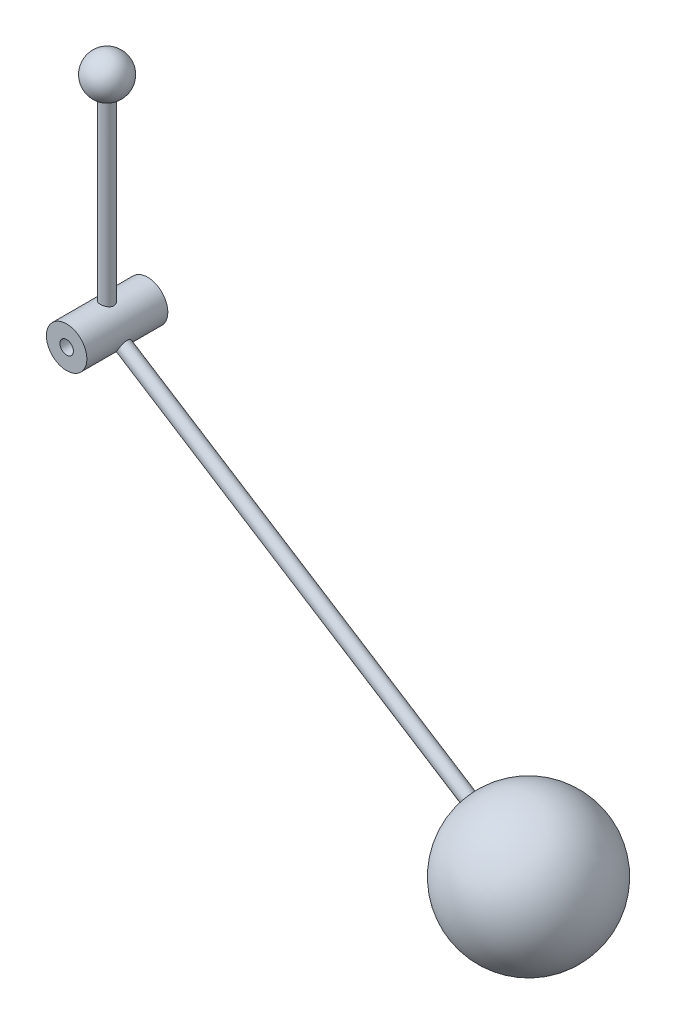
from build123d import *

# Parameters (mm, degrees)
BOSS_EXTRU_1_DEPTH      = 15
BOSS_EXTRU_1_DEPTH_BACK = 15
ESQUISSE3_R             = 7.5
ESQUISSE4_R             = 2.5
ENL_V_MAT_EXTRU_1_DEPTH = 93.803556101


with BuildPart() as part:
    # Esquisse1 → Base-R_volution (revolve)
    with BuildSketch(Plane.XY):
        with BuildLine():
            Line((-7.5, 0), (7.5, 0))
            ThreePointArc((7.5, 0), (0, 7.5), (-7.5, 0))
        make_face()
    revolve(axis=Axis((-40, 0, 0), (1, 0, 0)))

    # Esquisse2 → Boss.-R_vol.1 (revolve)
    with BuildSketch(Plane.XY, mode=Mode.PRIVATE) as boss_r_vol_1_sk:
        with BuildLine():
            Line((2.5, -7.071067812), (2.5, -80))
            Line((2.5, -80), (0, -80))
            Line((0, -80), (0, -7.5))
            ThreePointArc((0, -7.5), (1.26826484, -7.391989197), (2.5, -7.071067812))
        make_face()
    revolve(boss_r_vol_1_sk.sketch.rotate(Axis((0, 30, 0), (0, -1, 0)), 90), axis=Axis((0, 30, 0), (0, -1, 0)))

    # Esquisse3 → Boss.-Extru.1 (add, two sides: drawn at the far end of the back side and taken through both)
    with BuildSketch(Plane.XY.offset(-BOSS_EXTRU_1_DEPTH_BACK)):
        with Locations((0, -80)):
            Circle(ESQUISSE3_R)
    extrude(amount=BOSS_EXTRU_1_DEPTH + BOSS_EXTRU_1_DEPTH_BACK)

    # Esquisse4 → Enl_v. mat.-Extru.1 (cut, through all)
    with BuildSketch(Plane.XY.offset(15)):
        with Locations((0, -80)):
            Circle(ESQUISSE4_R)
    extrude(amount=-ENL_V_MAT_EXTRU_1_DEPTH, mode=Mode.SUBTRACT)

    # Esquisse5 → Boss.-R_vol.2 (revolve)
    with BuildSketch(Plane.XY, mode=Mode.PRIVATE) as boss_r_vol_2_sk:
        with BuildLine():
            Line((137.900074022, -164.791318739), (136.557885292, -166.900472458))
            Line((136.557885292, -166.900472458), (6.327461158, -84.026566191))
            ThreePointArc((6.327461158, -84.026566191), (6.917236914, -82.898591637), (7.30777632, -81.687129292))
            Line((7.30777632, -81.687129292), (137.900074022, -164.791318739))
        make_face()
    revolve(boss_r_vol_2_sk.sketch.rotate(Axis((0, -80, 0), (0.8436614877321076, -0.5368754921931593, 0)), 180), axis=Axis((0, -80, 0), (0.8436614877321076, -0.5368754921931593, 0)))

    # Esquisse6 → Boss.-R_vol.3 (revolve)
    with BuildSketch(Plane.XY):
        with BuildLine():
            Line((133.778882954, -165.132016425), (178.508919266, -193.596584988))
            ThreePointArc((178.508919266, -193.596584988), (170.376185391, -156.99928255), (133.778882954, -165.132016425))
        make_face()
    revolve(axis=Axis((0, -80, 0), (0.8436614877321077, -0.5368754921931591, 0)))


solid = part.part
